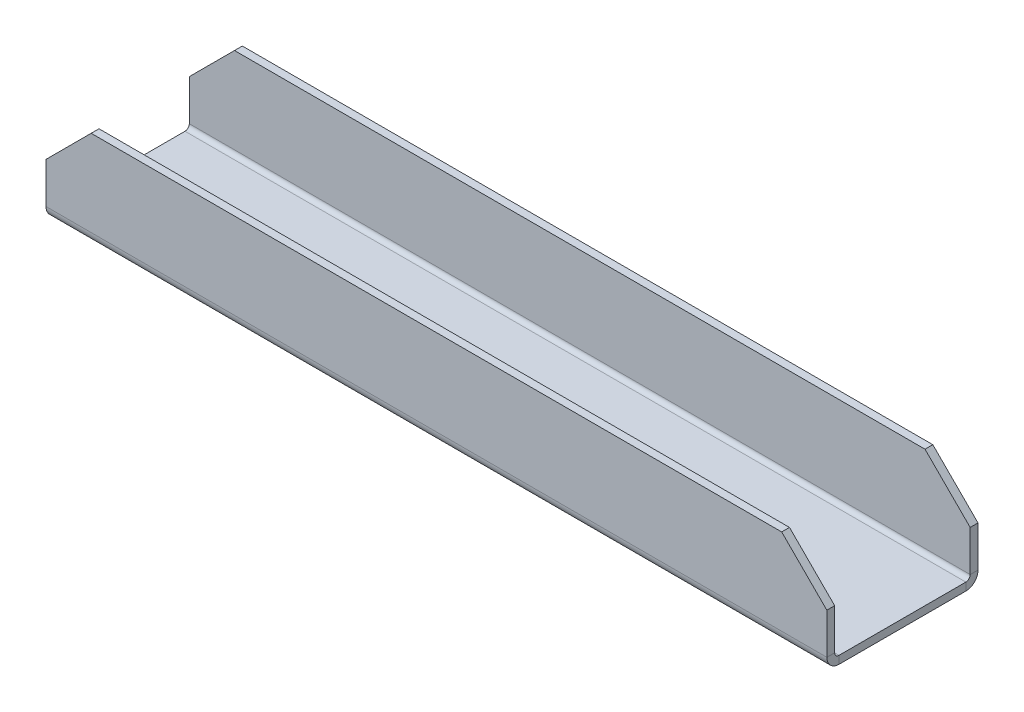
ISO-10303-21;
HEADER;
FILE_DESCRIPTION(('STEP AP214'),'2;1');
FILE_NAME('part.step','',(''),(''),'','','');
FILE_SCHEMA(('AUTOMOTIVE_DESIGN { 1 0 10303 214 1 1 1 1 }'));
ENDSEC;
DATA;
#1=APPLICATION_CONTEXT('core data for automotive mechanical design processes');
#2=APPLICATION_PROTOCOL_DEFINITION('international standard','automotive_design',2000,#1);
#3=PRODUCT_CONTEXT('',#1,'mechanical');
#4=PRODUCT('Part','Part','',(#3));
#5=PRODUCT_RELATED_PRODUCT_CATEGORY('part','',(#4));
#6=PRODUCT_DEFINITION_FORMATION('','',#4);
#7=PRODUCT_DEFINITION_CONTEXT('part definition',#1,'design');
#8=PRODUCT_DEFINITION('design','',#6,#7);
#9=PRODUCT_DEFINITION_SHAPE('','',#8);
#10=(LENGTH_UNIT() NAMED_UNIT(*) SI_UNIT(.MILLI.,.METRE.));
#11=(NAMED_UNIT(*) PLANE_ANGLE_UNIT() SI_UNIT($,.RADIAN.));
#12=(NAMED_UNIT(*) SI_UNIT($,.STERADIAN.) SOLID_ANGLE_UNIT());
#13=UNCERTAINTY_MEASURE_WITH_UNIT(LENGTH_MEASURE(1.E-05),#10,'distance_accuracy_value','');
#14=(GEOMETRIC_REPRESENTATION_CONTEXT(3) GLOBAL_UNCERTAINTY_ASSIGNED_CONTEXT((#13)) GLOBAL_UNIT_ASSIGNED_CONTEXT((#10,
#11,#12)) REPRESENTATION_CONTEXT('',''));
#15=CARTESIAN_POINT('',(0.,0.,0.));
#16=DIRECTION('',(0.,0.,1.));
#17=DIRECTION('',(1.,0.,0.));
#18=AXIS2_PLACEMENT_3D('',#15,#16,#17);
#19=CARTESIAN_POINT('',(114.3,0.,9.2837));
#20=DIRECTION('',(1.,0.,0.));
#21=DIRECTION('',(0.,0.,-1.));
#22=AXIS2_PLACEMENT_3D('',#19,#20,#21);
#23=PLANE('',#22);
#24=DIRECTION('',(0.,-1.,0.));
#25=VECTOR('',#24,1.);
#26=CARTESIAN_POINT('',(114.3,0.,9.2837));
#27=LINE('',#26,#25);
#28=CARTESIAN_POINT('',(114.3,0.,9.2837));
#29=VERTEX_POINT('',#28);
#30=CARTESIAN_POINT('',(114.3,-1.143,9.2837));
#31=VERTEX_POINT('',#30);
#32=EDGE_CURVE('E271',#29,#31,#27,.T.);
#33=ORIENTED_EDGE('',*,*,#32,.F.);
#34=CARTESIAN_POINT('',(114.3,0.635,9.2837));
#35=DIRECTION('',(-1.,0.,0.));
#36=DIRECTION('',(0.,0.,1.));
#37=AXIS2_PLACEMENT_3D('',#34,#35,#36);
#38=CIRCLE('',#37,0.635);
#39=CARTESIAN_POINT('',(114.3,0.634999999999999,9.9187));
#40=VERTEX_POINT('',#39);
#41=EDGE_CURVE('E190',#40,#29,#38,.F.);
#42=ORIENTED_EDGE('',*,*,#41,.F.);
#43=DIRECTION('',(0.,0.,-1.));
#44=VECTOR('',#43,1.);
#45=CARTESIAN_POINT('',(114.3,0.634999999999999,11.0617));
#46=LINE('',#45,#44);
#47=CARTESIAN_POINT('',(114.3,0.634999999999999,11.0617));
#48=VERTEX_POINT('',#47);
#49=EDGE_CURVE('E268',#48,#40,#46,.T.);
#50=ORIENTED_EDGE('',*,*,#49,.F.);
#51=CARTESIAN_POINT('',(114.3,0.635,9.2837));
#52=DIRECTION('',(1.,0.,0.));
#53=DIRECTION('',(0.,0.,-1.));
#54=AXIS2_PLACEMENT_3D('',#51,#52,#53);
#55=CIRCLE('',#54,1.778);
#56=EDGE_CURVE('E200',#48,#31,#55,.T.);
#57=ORIENTED_EDGE('',*,*,#56,.T.);
#58=EDGE_LOOP('',(#33,#42,#50,#57));
#59=FACE_BOUND('',#58,.T.);
#60=ADVANCED_FACE('F35',(#59),#23,.T.);
#61=CARTESIAN_POINT('',(114.3,0.634999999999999,11.0617));
#62=DIRECTION('',(1.,0.,0.));
#63=DIRECTION('',(0.,0.,-1.));
#64=AXIS2_PLACEMENT_3D('',#61,#62,#63);
#65=PLANE('',#64);
#66=DIRECTION('',(0.,0.,-1.));
#67=VECTOR('',#66,1.);
#68=CARTESIAN_POINT('',(114.3,0.,9.9187));
#69=LINE('',#68,#67);
#70=CARTESIAN_POINT('',(114.3,0.,-9.28369999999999));
#71=VERTEX_POINT('',#70);
#72=EDGE_CURVE('E188',#29,#71,#69,.T.);
#73=ORIENTED_EDGE('',*,*,#72,.F.);
#74=ORIENTED_EDGE('',*,*,#32,.T.);
#75=DIRECTION('',(0.,0.,-1.));
#76=VECTOR('',#75,1.);
#77=CARTESIAN_POINT('',(114.3,-1.143,9.9187));
#78=LINE('',#77,#76);
#79=CARTESIAN_POINT('',(114.3,-1.143,-9.28369999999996));
#80=VERTEX_POINT('',#79);
#81=EDGE_CURVE('E203',#31,#80,#78,.T.);
#82=ORIENTED_EDGE('',*,*,#81,.T.);
#83=DIRECTION('',(0.,1.,0.));
#84=VECTOR('',#83,1.);
#85=CARTESIAN_POINT('',(114.3,-1.143,-9.28369999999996));
#86=LINE('',#85,#84);
#87=EDGE_CURVE('E161',#80,#71,#86,.T.);
#88=ORIENTED_EDGE('',*,*,#87,.T.);
#89=EDGE_LOOP('',(#73,#74,#82,#88));
#90=FACE_BOUND('',#89,.T.);
#91=ADVANCED_FACE('F338',(#90),#65,.T.);
#92=CARTESIAN_POINT('',(0.,0.634999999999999,9.9187));
#93=DIRECTION('',(-1.,0.,0.));
#94=DIRECTION('',(0.,0.,1.));
#95=AXIS2_PLACEMENT_3D('',#92,#93,#94);
#96=PLANE('',#95);
#97=DIRECTION('',(0.,0.,1.));
#98=VECTOR('',#97,1.);
#99=CARTESIAN_POINT('',(0.,0.634999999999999,9.9187));
#100=LINE('',#99,#98);
#101=CARTESIAN_POINT('',(0.,0.634999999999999,9.9187));
#102=VERTEX_POINT('',#101);
#103=CARTESIAN_POINT('',(0.,0.634999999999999,11.0617));
#104=VERTEX_POINT('',#103);
#105=EDGE_CURVE('E265',#102,#104,#100,.T.);
#106=ORIENTED_EDGE('',*,*,#105,.F.);
#107=CARTESIAN_POINT('',(0.,0.635,9.2837));
#108=DIRECTION('',(-1.,0.,0.));
#109=DIRECTION('',(0.,0.,1.));
#110=AXIS2_PLACEMENT_3D('',#107,#108,#109);
#111=CIRCLE('',#110,0.635);
#112=CARTESIAN_POINT('',(0.,0.,9.2837));
#113=VERTEX_POINT('',#112);
#114=EDGE_CURVE('E217',#102,#113,#111,.F.);
#115=ORIENTED_EDGE('',*,*,#114,.T.);
#116=DIRECTION('',(0.,1.,0.));
#117=VECTOR('',#116,1.);
#118=CARTESIAN_POINT('',(0.,-1.143,9.2837));
#119=LINE('',#118,#117);
#120=CARTESIAN_POINT('',(0.,-1.143,9.2837));
#121=VERTEX_POINT('',#120);
#122=EDGE_CURVE('E160',#121,#113,#119,.T.);
#123=ORIENTED_EDGE('',*,*,#122,.F.);
#124=CARTESIAN_POINT('',(0.,0.635,9.2837));
#125=DIRECTION('',(1.,0.,0.));
#126=DIRECTION('',(0.,0.,-1.));
#127=AXIS2_PLACEMENT_3D('',#124,#125,#126);
#128=CIRCLE('',#127,1.778);
#129=EDGE_CURVE('E224',#104,#121,#128,.T.);
#130=ORIENTED_EDGE('',*,*,#129,.F.);
#131=EDGE_LOOP('',(#106,#115,#123,#130));
#132=FACE_BOUND('',#131,.T.);
#133=ADVANCED_FACE('F319',(#132),#96,.T.);
#134=CARTESIAN_POINT('',(0.,-1.143,9.2837));
#135=DIRECTION('',(-1.,0.,0.));
#136=DIRECTION('',(0.,0.,1.));
#137=AXIS2_PLACEMENT_3D('',#134,#135,#136);
#138=PLANE('',#137);
#139=DIRECTION('',(0.,1.,0.));
#140=VECTOR('',#139,1.);
#141=CARTESIAN_POINT('',(0.,0.,11.0617));
#142=LINE('',#141,#140);
#143=CARTESIAN_POINT('',(0.,6.61246666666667,11.0617));
#144=VERTEX_POINT('',#143);
#145=EDGE_CURVE('E222',#144,#104,#142,.F.);
#146=ORIENTED_EDGE('',*,*,#145,.F.);
#147=DIRECTION('',(0.,0.,-1.));
#148=VECTOR('',#147,1.);
#149=CARTESIAN_POINT('',(0.,6.61246666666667,9.2837));
#150=LINE('',#149,#148);
#151=CARTESIAN_POINT('',(0.,6.61246666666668,9.9187));
#152=VERTEX_POINT('',#151);
#153=EDGE_CURVE('E299',#144,#152,#150,.T.);
#154=ORIENTED_EDGE('',*,*,#153,.T.);
#155=DIRECTION('',(0.,-1.,0.));
#156=VECTOR('',#155,1.);
#157=CARTESIAN_POINT('',(0.,0.,9.9187));
#158=LINE('',#157,#156);
#159=EDGE_CURVE('E220',#152,#102,#158,.T.);
#160=ORIENTED_EDGE('',*,*,#159,.T.);
#161=ORIENTED_EDGE('',*,*,#105,.T.);
#162=EDGE_LOOP('',(#146,#154,#160,#161));
#163=FACE_BOUND('',#162,.T.);
#164=ADVANCED_FACE('F305',(#163),#138,.T.);
#165=CARTESIAN_POINT('',(114.3,0.635,-9.9187));
#166=DIRECTION('',(1.,0.,0.));
#167=DIRECTION('',(0.,0.,-1.));
#168=AXIS2_PLACEMENT_3D('',#165,#166,#167);
#169=PLANE('',#168);
#170=DIRECTION('',(0.,0.,-1.));
#171=VECTOR('',#170,1.);
#172=CARTESIAN_POINT('',(114.3,0.635,-9.9187));
#173=LINE('',#172,#171);
#174=CARTESIAN_POINT('',(114.3,0.635,-9.9187));
#175=VERTEX_POINT('',#174);
#176=CARTESIAN_POINT('',(114.3,0.635,-11.0617));
#177=VERTEX_POINT('',#176);
#178=EDGE_CURVE('E148',#175,#177,#173,.T.);
#179=ORIENTED_EDGE('',*,*,#178,.F.);
#180=CARTESIAN_POINT('',(114.3,0.635,-9.2837));
#181=DIRECTION('',(-1.,0.,0.));
#182=DIRECTION('',(0.,0.,1.));
#183=AXIS2_PLACEMENT_3D('',#180,#181,#182);
#184=CIRCLE('',#183,0.635);
#185=EDGE_CURVE('E152',#71,#175,#184,.F.);
#186=ORIENTED_EDGE('',*,*,#185,.F.);
#187=ORIENTED_EDGE('',*,*,#87,.F.);
#188=CARTESIAN_POINT('',(114.3,0.635,-9.2837));
#189=DIRECTION('',(1.,0.,0.));
#190=DIRECTION('',(0.,0.,-1.));
#191=AXIS2_PLACEMENT_3D('',#188,#189,#190);
#192=CIRCLE('',#191,1.778);
#193=EDGE_CURVE('E155',#80,#177,#192,.T.);
#194=ORIENTED_EDGE('',*,*,#193,.T.);
#195=EDGE_LOOP('',(#179,#186,#187,#194));
#196=FACE_BOUND('',#195,.T.);
#197=ADVANCED_FACE('F150',(#196),#169,.T.);
#198=CARTESIAN_POINT('',(114.3,-1.143,-9.28369999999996));
#199=DIRECTION('',(1.,0.,0.));
#200=DIRECTION('',(0.,0.,-1.));
#201=AXIS2_PLACEMENT_3D('',#198,#199,#200);
#202=PLANE('',#201);
#203=DIRECTION('',(0.,1.,0.));
#204=VECTOR('',#203,1.);
#205=CARTESIAN_POINT('',(114.3,0.,-11.0617));
#206=LINE('',#205,#204);
#207=CARTESIAN_POINT('',(114.3,6.61246666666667,-11.0617));
#208=VERTEX_POINT('',#207);
#209=EDGE_CURVE('E183',#177,#208,#206,.T.);
#210=ORIENTED_EDGE('',*,*,#209,.T.);
#211=DIRECTION('',(0.,0.,1.));
#212=VECTOR('',#211,1.);
#213=CARTESIAN_POINT('',(114.3,6.61246666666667,-9.28369999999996));
#214=LINE('',#213,#212);
#215=CARTESIAN_POINT('',(114.3,6.61246666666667,-9.9187));
#216=VERTEX_POINT('',#215);
#217=EDGE_CURVE('E182',#208,#216,#214,.T.);
#218=ORIENTED_EDGE('',*,*,#217,.T.);
#219=DIRECTION('',(0.,1.,0.));
#220=VECTOR('',#219,1.);
#221=CARTESIAN_POINT('',(114.3,0.,-9.9187));
#222=LINE('',#221,#220);
#223=EDGE_CURVE('E170',#175,#216,#222,.T.);
#224=ORIENTED_EDGE('',*,*,#223,.F.);
#225=ORIENTED_EDGE('',*,*,#178,.T.);
#226=EDGE_LOOP('',(#210,#218,#224,#225));
#227=FACE_BOUND('',#226,.T.);
#228=ADVANCED_FACE('F180',(#227),#202,.T.);
#229=CARTESIAN_POINT('',(0.,0.,-9.28369999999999));
#230=DIRECTION('',(-1.,0.,0.));
#231=DIRECTION('',(0.,0.,1.));
#232=AXIS2_PLACEMENT_3D('',#229,#230,#231);
#233=PLANE('',#232);
#234=DIRECTION('',(0.,-1.,0.));
#235=VECTOR('',#234,1.);
#236=CARTESIAN_POINT('',(0.,0.,-9.28369999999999));
#237=LINE('',#236,#235);
#238=CARTESIAN_POINT('',(0.,0.,-9.28369999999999));
#239=VERTEX_POINT('',#238);
#240=CARTESIAN_POINT('',(0.,-1.143,-9.28369999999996));
#241=VERTEX_POINT('',#240);
#242=EDGE_CURVE('E261',#239,#241,#237,.T.);
#243=ORIENTED_EDGE('',*,*,#242,.F.);
#244=CARTESIAN_POINT('',(0.,0.635,-9.2837));
#245=DIRECTION('',(-1.,0.,0.));
#246=DIRECTION('',(0.,0.,1.));
#247=AXIS2_PLACEMENT_3D('',#244,#245,#246);
#248=CIRCLE('',#247,0.635);
#249=CARTESIAN_POINT('',(0.,0.635,-9.9187));
#250=VERTEX_POINT('',#249);
#251=EDGE_CURVE('E212',#239,#250,#248,.F.);
#252=ORIENTED_EDGE('',*,*,#251,.T.);
#253=DIRECTION('',(0.,0.,1.));
#254=VECTOR('',#253,1.);
#255=CARTESIAN_POINT('',(0.,0.635,-11.0617));
#256=LINE('',#255,#254);
#257=CARTESIAN_POINT('',(0.,0.635,-11.0617));
#258=VERTEX_POINT('',#257);
#259=EDGE_CURVE('E259',#258,#250,#256,.T.);
#260=ORIENTED_EDGE('',*,*,#259,.F.);
#261=CARTESIAN_POINT('',(0.,0.635,-9.2837));
#262=DIRECTION('',(1.,0.,0.));
#263=DIRECTION('',(0.,0.,-1.));
#264=AXIS2_PLACEMENT_3D('',#261,#262,#263);
#265=CIRCLE('',#264,1.778);
#266=EDGE_CURVE('E230',#241,#258,#265,.T.);
#267=ORIENTED_EDGE('',*,*,#266,.F.);
#268=EDGE_LOOP('',(#243,#252,#260,#267));
#269=FACE_BOUND('',#268,.T.);
#270=ADVANCED_FACE('F369',(#269),#233,.T.);
#271=CARTESIAN_POINT('',(0.,0.635,-11.0617));
#272=DIRECTION('',(-1.,0.,0.));
#273=DIRECTION('',(0.,0.,1.));
#274=AXIS2_PLACEMENT_3D('',#271,#272,#273);
#275=PLANE('',#274);
#276=DIRECTION('',(0.,0.,-1.));
#277=VECTOR('',#276,1.);
#278=CARTESIAN_POINT('',(0.,0.,9.9187));
#279=LINE('',#278,#277);
#280=EDGE_CURVE('E214',#113,#239,#279,.T.);
#281=ORIENTED_EDGE('',*,*,#280,.T.);
#282=ORIENTED_EDGE('',*,*,#242,.T.);
#283=DIRECTION('',(0.,0.,-1.));
#284=VECTOR('',#283,1.);
#285=CARTESIAN_POINT('',(0.,-1.143,9.9187));
#286=LINE('',#285,#284);
#287=EDGE_CURVE('E227',#121,#241,#286,.T.);
#288=ORIENTED_EDGE('',*,*,#287,.F.);
#289=ORIENTED_EDGE('',*,*,#122,.T.);
#290=EDGE_LOOP('',(#281,#282,#288,#289));
#291=FACE_BOUND('',#290,.T.);
#292=ADVANCED_FACE('F377',(#291),#275,.T.);
#293=CARTESIAN_POINT('',(114.3,0.,-11.0617));
#294=DIRECTION('',(0.,0.,1.));
#295=DIRECTION('',(1.,0.,0.));
#296=AXIS2_PLACEMENT_3D('',#293,#294,#295);
#297=PLANE('',#296);
#298=DIRECTION('',(0.,1.,0.));
#299=VECTOR('',#298,1.);
#300=CARTESIAN_POINT('',(0.,0.,-11.0617));
#301=LINE('',#300,#299);
#302=CARTESIAN_POINT('',(0.,6.61246666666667,-11.0617));
#303=VERTEX_POINT('',#302);
#304=EDGE_CURVE('E208',#258,#303,#301,.T.);
#305=ORIENTED_EDGE('',*,*,#304,.T.);
#306=DIRECTION('',(-0.707106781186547,-0.707106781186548,0.));
#307=VECTOR('',#306,1.);
#308=CARTESIAN_POINT('',(0.,6.61246666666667,-11.0617));
#309=LINE('',#308,#307);
#310=CARTESIAN_POINT('',(6.61246666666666,13.2249333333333,-11.0617));
#311=VERTEX_POINT('',#310);
#312=EDGE_CURVE('E293',#303,#311,#309,.F.);
#313=ORIENTED_EDGE('',*,*,#312,.T.);
#314=DIRECTION('',(-1.,0.,0.));
#315=VECTOR('',#314,1.);
#316=CARTESIAN_POINT('',(114.3,13.2249333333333,-11.0617));
#317=LINE('',#316,#315);
#318=CARTESIAN_POINT('',(107.687533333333,13.2249333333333,-11.0617));
#319=VERTEX_POINT('',#318);
#320=EDGE_CURVE('E256',#319,#311,#317,.T.);
#321=ORIENTED_EDGE('',*,*,#320,.F.);
#322=DIRECTION('',(-0.707106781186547,0.707106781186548,0.));
#323=VECTOR('',#322,1.);
#324=CARTESIAN_POINT('',(107.687533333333,13.2249333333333,-11.0617));
#325=LINE('',#324,#323);
#326=EDGE_CURVE('E285',#319,#208,#325,.F.);
#327=ORIENTED_EDGE('',*,*,#326,.T.);
#328=ORIENTED_EDGE('',*,*,#209,.F.);
#329=DIRECTION('',(-1.,0.,0.));
#330=VECTOR('',#329,1.);
#331=CARTESIAN_POINT('',(114.3,0.635,-11.0617));
#332=LINE('',#331,#330);
#333=EDGE_CURVE('E207',#177,#258,#332,.T.);
#334=ORIENTED_EDGE('',*,*,#333,.T.);
#335=EDGE_LOOP('',(#305,#313,#321,#327,#328,#334));
#336=FACE_BOUND('',#335,.T.);
#337=ADVANCED_FACE('F375',(#336),#297,.F.);
#338=CARTESIAN_POINT('',(114.3,13.2249333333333,-9.9187));
#339=DIRECTION('',(0.,1.,0.));
#340=DIRECTION('',(0.,0.,1.));
#341=AXIS2_PLACEMENT_3D('',#338,#339,#340);
#342=PLANE('',#341);
#343=ORIENTED_EDGE('',*,*,#320,.T.);
#344=DIRECTION('',(0.,0.,1.));
#345=VECTOR('',#344,1.);
#346=CARTESIAN_POINT('',(6.61246666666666,13.2249333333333,-9.9187));
#347=LINE('',#346,#345);
#348=CARTESIAN_POINT('',(6.61246666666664,13.2249333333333,-9.9187));
#349=VERTEX_POINT('',#348);
#350=EDGE_CURVE('E295',#311,#349,#347,.T.);
#351=ORIENTED_EDGE('',*,*,#350,.T.);
#352=DIRECTION('',(-1.,0.,0.));
#353=VECTOR('',#352,1.);
#354=CARTESIAN_POINT('',(114.3,13.2249333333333,-9.9187));
#355=LINE('',#354,#353);
#356=CARTESIAN_POINT('',(107.687533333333,13.2249333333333,-9.9187));
#357=VERTEX_POINT('',#356);
#358=EDGE_CURVE('E177',#357,#349,#355,.T.);
#359=ORIENTED_EDGE('',*,*,#358,.F.);
#360=DIRECTION('',(0.,0.,-1.));
#361=VECTOR('',#360,1.);
#362=CARTESIAN_POINT('',(107.687533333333,13.2249333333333,-9.9187));
#363=LINE('',#362,#361);
#364=EDGE_CURVE('E282',#357,#319,#363,.T.);
#365=ORIENTED_EDGE('',*,*,#364,.T.);
#366=EDGE_LOOP('',(#343,#351,#359,#365));
#367=FACE_BOUND('',#366,.T.);
#368=ADVANCED_FACE('F361',(#367),#342,.T.);
#369=CARTESIAN_POINT('',(114.3,0.,-9.9187));
#370=DIRECTION('',(0.,0.,1.));
#371=DIRECTION('',(1.,0.,0.));
#372=AXIS2_PLACEMENT_3D('',#369,#370,#371);
#373=PLANE('',#372);
#374=ORIENTED_EDGE('',*,*,#358,.T.);
#375=DIRECTION('',(0.707106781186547,0.707106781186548,0.));
#376=VECTOR('',#375,1.);
#377=CARTESIAN_POINT('',(53.8437666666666,60.4562333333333,-9.9187));
#378=LINE('',#377,#376);
#379=CARTESIAN_POINT('',(0.,6.61246666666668,-9.9187));
#380=VERTEX_POINT('',#379);
#381=EDGE_CURVE('E297',#349,#380,#378,.F.);
#382=ORIENTED_EDGE('',*,*,#381,.T.);
#383=DIRECTION('',(0.,1.,0.));
#384=VECTOR('',#383,1.);
#385=CARTESIAN_POINT('',(0.,0.,-9.9187));
#386=LINE('',#385,#384);
#387=EDGE_CURVE('E173',#250,#380,#386,.T.);
#388=ORIENTED_EDGE('',*,*,#387,.F.);
#389=DIRECTION('',(-1.,0.,0.));
#390=VECTOR('',#389,1.);
#391=CARTESIAN_POINT('',(114.3,0.635,-9.9187));
#392=LINE('',#391,#390);
#393=EDGE_CURVE('E167',#175,#250,#392,.T.);
#394=ORIENTED_EDGE('',*,*,#393,.F.);
#395=ORIENTED_EDGE('',*,*,#223,.T.);
#396=DIRECTION('',(0.707106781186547,-0.707106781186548,0.));
#397=VECTOR('',#396,1.);
#398=CARTESIAN_POINT('',(117.606233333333,3.30623333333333,-9.9187));
#399=LINE('',#398,#397);
#400=EDGE_CURVE('E288',#216,#357,#399,.F.);
#401=ORIENTED_EDGE('',*,*,#400,.T.);
#402=EDGE_LOOP('',(#374,#382,#388,#394,#395,#401));
#403=FACE_BOUND('',#402,.T.);
#404=ADVANCED_FACE('F169',(#403),#373,.T.);
#405=CARTESIAN_POINT('',(114.3,0.635,-9.2837));
#406=DIRECTION('',(-1.,0.,0.));
#407=DIRECTION('',(0.,0.,1.));
#408=AXIS2_PLACEMENT_3D('',#405,#406,#407);
#409=CYLINDRICAL_SURFACE('',#408,0.635);
#410=ORIENTED_EDGE('',*,*,#251,.F.);
#411=DIRECTION('',(-1.,0.,0.));
#412=VECTOR('',#411,1.);
#413=CARTESIAN_POINT('',(114.3,0.,-9.28369999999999));
#414=LINE('',#413,#412);
#415=EDGE_CURVE('E178',#71,#239,#414,.T.);
#416=ORIENTED_EDGE('',*,*,#415,.F.);
#417=ORIENTED_EDGE('',*,*,#185,.T.);
#418=ORIENTED_EDGE('',*,*,#393,.T.);
#419=EDGE_LOOP('',(#410,#416,#417,#418));
#420=FACE_BOUND('',#419,.T.);
#421=ADVANCED_FACE('F186',(#420),#409,.F.);
#422=CARTESIAN_POINT('',(114.3,0.,9.9187));
#423=DIRECTION('',(0.,1.,0.));
#424=DIRECTION('',(0.,0.,1.));
#425=AXIS2_PLACEMENT_3D('',#422,#423,#424);
#426=PLANE('',#425);
#427=ORIENTED_EDGE('',*,*,#280,.F.);
#428=DIRECTION('',(-1.,0.,0.));
#429=VECTOR('',#428,1.);
#430=CARTESIAN_POINT('',(114.3,0.,9.2837));
#431=LINE('',#430,#429);
#432=EDGE_CURVE('E251',#29,#113,#431,.T.);
#433=ORIENTED_EDGE('',*,*,#432,.F.);
#434=ORIENTED_EDGE('',*,*,#72,.T.);
#435=ORIENTED_EDGE('',*,*,#415,.T.);
#436=EDGE_LOOP('',(#427,#433,#434,#435));
#437=FACE_BOUND('',#436,.T.);
#438=ADVANCED_FACE('F432',(#437),#426,.T.);
#439=CARTESIAN_POINT('',(114.3,0.635,9.2837));
#440=DIRECTION('',(-1.,0.,0.));
#441=DIRECTION('',(0.,0.,1.));
#442=AXIS2_PLACEMENT_3D('',#439,#440,#441);
#443=CYLINDRICAL_SURFACE('',#442,0.635);
#444=ORIENTED_EDGE('',*,*,#114,.F.);
#445=DIRECTION('',(-1.,0.,0.));
#446=VECTOR('',#445,1.);
#447=CARTESIAN_POINT('',(114.3,0.634999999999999,9.9187));
#448=LINE('',#447,#446);
#449=EDGE_CURVE('E248',#40,#102,#448,.T.);
#450=ORIENTED_EDGE('',*,*,#449,.F.);
#451=ORIENTED_EDGE('',*,*,#41,.T.);
#452=ORIENTED_EDGE('',*,*,#432,.T.);
#453=EDGE_LOOP('',(#444,#450,#451,#452));
#454=FACE_BOUND('',#453,.T.);
#455=ADVANCED_FACE('F315',(#454),#443,.F.);
#456=CARTESIAN_POINT('',(114.3,0.,9.9187));
#457=DIRECTION('',(0.,0.,-1.));
#458=DIRECTION('',(-1.,0.,0.));
#459=AXIS2_PLACEMENT_3D('',#456,#457,#458);
#460=PLANE('',#459);
#461=ORIENTED_EDGE('',*,*,#159,.F.);
#462=DIRECTION('',(-0.707106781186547,-0.707106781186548,0.));
#463=VECTOR('',#462,1.);
#464=CARTESIAN_POINT('',(53.8437666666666,60.4562333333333,9.9187));
#465=LINE('',#464,#463);
#466=CARTESIAN_POINT('',(6.61246666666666,13.2249333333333,9.9187));
#467=VERTEX_POINT('',#466);
#468=EDGE_CURVE('E57',#152,#467,#465,.F.);
#469=ORIENTED_EDGE('',*,*,#468,.T.);
#470=DIRECTION('',(-1.,0.,0.));
#471=VECTOR('',#470,1.);
#472=CARTESIAN_POINT('',(114.3,13.2249333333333,9.9187));
#473=LINE('',#472,#471);
#474=CARTESIAN_POINT('',(107.687533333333,13.2249333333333,9.9187));
#475=VERTEX_POINT('',#474);
#476=EDGE_CURVE('E246',#475,#467,#473,.T.);
#477=ORIENTED_EDGE('',*,*,#476,.F.);
#478=DIRECTION('',(0.707106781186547,-0.707106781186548,0.));
#479=VECTOR('',#478,1.);
#480=CARTESIAN_POINT('',(117.606233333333,3.30623333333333,9.9187));
#481=LINE('',#480,#479);
#482=CARTESIAN_POINT('',(114.3,6.61246666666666,9.9187));
#483=VERTEX_POINT('',#482);
#484=EDGE_CURVE('E276',#475,#483,#481,.T.);
#485=ORIENTED_EDGE('',*,*,#484,.T.);
#486=DIRECTION('',(0.,-1.,0.));
#487=VECTOR('',#486,1.);
#488=CARTESIAN_POINT('',(114.3,0.,9.9187));
#489=LINE('',#488,#487);
#490=EDGE_CURVE('E196',#483,#40,#489,.T.);
#491=ORIENTED_EDGE('',*,*,#490,.T.);
#492=ORIENTED_EDGE('',*,*,#449,.T.);
#493=EDGE_LOOP('',(#461,#469,#477,#485,#491,#492));
#494=FACE_BOUND('',#493,.T.);
#495=ADVANCED_FACE('F309',(#494),#460,.T.);
#496=CARTESIAN_POINT('',(114.3,13.2249333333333,11.0617));
#497=DIRECTION('',(0.,1.,0.));
#498=DIRECTION('',(0.,0.,1.));
#499=AXIS2_PLACEMENT_3D('',#496,#497,#498);
#500=PLANE('',#499);
#501=ORIENTED_EDGE('',*,*,#476,.T.);
#502=DIRECTION('',(0.,0.,1.));
#503=VECTOR('',#502,1.);
#504=CARTESIAN_POINT('',(6.61246666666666,13.2249333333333,11.0617));
#505=LINE('',#504,#503);
#506=CARTESIAN_POINT('',(6.61246666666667,13.2249333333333,11.0617));
#507=VERTEX_POINT('',#506);
#508=EDGE_CURVE('E43',#467,#507,#505,.T.);
#509=ORIENTED_EDGE('',*,*,#508,.T.);
#510=DIRECTION('',(-1.,0.,0.));
#511=VECTOR('',#510,1.);
#512=CARTESIAN_POINT('',(114.3,13.2249333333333,11.0617));
#513=LINE('',#512,#511);
#514=CARTESIAN_POINT('',(107.687533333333,13.2249333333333,11.0617));
#515=VERTEX_POINT('',#514);
#516=EDGE_CURVE('E244',#515,#507,#513,.T.);
#517=ORIENTED_EDGE('',*,*,#516,.F.);
#518=DIRECTION('',(0.,0.,-1.));
#519=VECTOR('',#518,1.);
#520=CARTESIAN_POINT('',(107.687533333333,13.2249333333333,9.9187));
#521=LINE('',#520,#519);
#522=EDGE_CURVE('E273',#515,#475,#521,.T.);
#523=ORIENTED_EDGE('',*,*,#522,.T.);
#524=EDGE_LOOP('',(#501,#509,#517,#523));
#525=FACE_BOUND('',#524,.T.);
#526=ADVANCED_FACE('F567',(#525),#500,.T.);
#527=CARTESIAN_POINT('',(114.3,0.,11.0617));
#528=DIRECTION('',(0.,0.,-1.));
#529=DIRECTION('',(-1.,0.,0.));
#530=AXIS2_PLACEMENT_3D('',#527,#528,#529);
#531=PLANE('',#530);
#532=ORIENTED_EDGE('',*,*,#516,.T.);
#533=DIRECTION('',(0.707106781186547,0.707106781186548,0.));
#534=VECTOR('',#533,1.);
#535=CARTESIAN_POINT('',(0.,6.61246666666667,11.0617));
#536=LINE('',#535,#534);
#537=EDGE_CURVE('E11',#507,#144,#536,.F.);
#538=ORIENTED_EDGE('',*,*,#537,.T.);
#539=ORIENTED_EDGE('',*,*,#145,.T.);
#540=DIRECTION('',(-1.,0.,0.));
#541=VECTOR('',#540,1.);
#542=CARTESIAN_POINT('',(114.3,0.634999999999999,11.0617));
#543=LINE('',#542,#541);
#544=EDGE_CURVE('E241',#48,#104,#543,.T.);
#545=ORIENTED_EDGE('',*,*,#544,.F.);
#546=DIRECTION('',(0.,1.,0.));
#547=VECTOR('',#546,1.);
#548=CARTESIAN_POINT('',(114.3,0.,11.0617));
#549=LINE('',#548,#547);
#550=CARTESIAN_POINT('',(114.3,6.61246666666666,11.0617));
#551=VERTEX_POINT('',#550);
#552=EDGE_CURVE('E198',#551,#48,#549,.F.);
#553=ORIENTED_EDGE('',*,*,#552,.F.);
#554=DIRECTION('',(-0.707106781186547,0.707106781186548,0.));
#555=VECTOR('',#554,1.);
#556=CARTESIAN_POINT('',(107.687533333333,13.2249333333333,11.0617));
#557=LINE('',#556,#555);
#558=EDGE_CURVE('E280',#551,#515,#557,.T.);
#559=ORIENTED_EDGE('',*,*,#558,.T.);
#560=EDGE_LOOP('',(#532,#538,#539,#545,#553,#559));
#561=FACE_BOUND('',#560,.T.);
#562=ADVANCED_FACE('F328',(#561),#531,.F.);
#563=CARTESIAN_POINT('',(114.3,0.635,9.2837));
#564=DIRECTION('',(-1.,0.,0.));
#565=DIRECTION('',(0.,0.,1.));
#566=AXIS2_PLACEMENT_3D('',#563,#564,#565);
#567=CYLINDRICAL_SURFACE('',#566,1.778);
#568=ORIENTED_EDGE('',*,*,#129,.T.);
#569=DIRECTION('',(-1.,0.,0.));
#570=VECTOR('',#569,1.);
#571=CARTESIAN_POINT('',(114.3,-1.143,9.2837));
#572=LINE('',#571,#570);
#573=EDGE_CURVE('E238',#31,#121,#572,.T.);
#574=ORIENTED_EDGE('',*,*,#573,.F.);
#575=ORIENTED_EDGE('',*,*,#56,.F.);
#576=ORIENTED_EDGE('',*,*,#544,.T.);
#577=EDGE_LOOP('',(#568,#574,#575,#576));
#578=FACE_BOUND('',#577,.T.);
#579=ADVANCED_FACE('F324',(#578),#567,.T.);
#580=CARTESIAN_POINT('',(114.3,-1.143,9.9187));
#581=DIRECTION('',(0.,1.,0.));
#582=DIRECTION('',(0.,0.,1.));
#583=AXIS2_PLACEMENT_3D('',#580,#581,#582);
#584=PLANE('',#583);
#585=ORIENTED_EDGE('',*,*,#287,.T.);
#586=DIRECTION('',(-1.,0.,0.));
#587=VECTOR('',#586,1.);
#588=CARTESIAN_POINT('',(114.3,-1.143,-9.28369999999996));
#589=LINE('',#588,#587);
#590=EDGE_CURVE('E235',#80,#241,#589,.T.);
#591=ORIENTED_EDGE('',*,*,#590,.F.);
#592=ORIENTED_EDGE('',*,*,#81,.F.);
#593=ORIENTED_EDGE('',*,*,#573,.T.);
#594=EDGE_LOOP('',(#585,#591,#592,#593));
#595=FACE_BOUND('',#594,.T.);
#596=ADVANCED_FACE('F465',(#595),#584,.F.);
#597=CARTESIAN_POINT('',(114.3,0.635,-9.2837));
#598=DIRECTION('',(-1.,0.,0.));
#599=DIRECTION('',(0.,0.,1.));
#600=AXIS2_PLACEMENT_3D('',#597,#598,#599);
#601=CYLINDRICAL_SURFACE('',#600,1.778);
#602=ORIENTED_EDGE('',*,*,#266,.T.);
#603=ORIENTED_EDGE('',*,*,#333,.F.);
#604=ORIENTED_EDGE('',*,*,#193,.F.);
#605=ORIENTED_EDGE('',*,*,#590,.T.);
#606=EDGE_LOOP('',(#602,#603,#604,#605));
#607=FACE_BOUND('',#606,.T.);
#608=ADVANCED_FACE('F371',(#607),#601,.T.);
#609=CARTESIAN_POINT('',(114.3,0.635,-9.2837));
#610=DIRECTION('',(-1.,0.,0.));
#611=DIRECTION('',(0.,0.,1.));
#612=AXIS2_PLACEMENT_3D('',#609,#610,#611);
#613=PLANE('',#612);
#614=ORIENTED_EDGE('',*,*,#490,.F.);
#615=DIRECTION('',(0.,0.,1.));
#616=VECTOR('',#615,1.);
#617=CARTESIAN_POINT('',(114.3,6.61246666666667,11.0617));
#618=LINE('',#617,#616);
#619=EDGE_CURVE('E278',#483,#551,#618,.T.);
#620=ORIENTED_EDGE('',*,*,#619,.T.);
#621=ORIENTED_EDGE('',*,*,#552,.T.);
#622=ORIENTED_EDGE('',*,*,#49,.T.);
#623=EDGE_LOOP('',(#614,#620,#621,#622));
#624=FACE_BOUND('',#623,.T.);
#625=ADVANCED_FACE('F485',(#624),#613,.F.);
#626=CARTESIAN_POINT('',(0.,0.635,-9.2837));
#627=DIRECTION('',(-1.,0.,0.));
#628=DIRECTION('',(0.,0.,1.));
#629=AXIS2_PLACEMENT_3D('',#626,#627,#628);
#630=PLANE('',#629);
#631=ORIENTED_EDGE('',*,*,#387,.T.);
#632=DIRECTION('',(0.,0.,-1.));
#633=VECTOR('',#632,1.);
#634=CARTESIAN_POINT('',(0.,6.61246666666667,-9.2837));
#635=LINE('',#634,#633);
#636=EDGE_CURVE('E290',#380,#303,#635,.T.);
#637=ORIENTED_EDGE('',*,*,#636,.T.);
#638=ORIENTED_EDGE('',*,*,#304,.F.);
#639=ORIENTED_EDGE('',*,*,#259,.T.);
#640=EDGE_LOOP('',(#631,#637,#638,#639));
#641=FACE_BOUND('',#640,.T.);
#642=ADVANCED_FACE('F351',(#641),#630,.T.);
#643=CARTESIAN_POINT('',(107.687533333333,13.2249333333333,11.0617));
#644=DIRECTION('',(0.707106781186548,0.707106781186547,0.));
#645=DIRECTION('',(-0.707106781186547,0.707106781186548,0.));
#646=AXIS2_PLACEMENT_3D('',#643,#644,#645);
#647=PLANE('',#646);
#648=ORIENTED_EDGE('',*,*,#558,.F.);
#649=ORIENTED_EDGE('',*,*,#619,.F.);
#650=ORIENTED_EDGE('',*,*,#484,.F.);
#651=ORIENTED_EDGE('',*,*,#522,.F.);
#652=EDGE_LOOP('',(#648,#649,#650,#651));
#653=FACE_BOUND('',#652,.T.);
#654=ADVANCED_FACE('F348',(#653),#647,.T.);
#655=CARTESIAN_POINT('',(107.687533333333,13.2249333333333,-9.9187));
#656=DIRECTION('',(-0.707106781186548,-0.707106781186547,0.));
#657=DIRECTION('',(0.707106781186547,-0.707106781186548,0.));
#658=AXIS2_PLACEMENT_3D('',#655,#656,#657);
#659=PLANE('',#658);
#660=ORIENTED_EDGE('',*,*,#400,.F.);
#661=ORIENTED_EDGE('',*,*,#217,.F.);
#662=ORIENTED_EDGE('',*,*,#326,.F.);
#663=ORIENTED_EDGE('',*,*,#364,.F.);
#664=EDGE_LOOP('',(#660,#661,#662,#663));
#665=FACE_BOUND('',#664,.T.);
#666=ADVANCED_FACE('F335',(#665),#659,.F.);
#667=CARTESIAN_POINT('',(0.,6.61246666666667,-9.2837));
#668=DIRECTION('',(0.707106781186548,-0.707106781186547,0.));
#669=DIRECTION('',(0.707106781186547,0.707106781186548,0.));
#670=AXIS2_PLACEMENT_3D('',#667,#668,#669);
#671=PLANE('',#670);
#672=ORIENTED_EDGE('',*,*,#381,.F.);
#673=ORIENTED_EDGE('',*,*,#350,.F.);
#674=ORIENTED_EDGE('',*,*,#312,.F.);
#675=ORIENTED_EDGE('',*,*,#636,.F.);
#676=EDGE_LOOP('',(#672,#673,#674,#675));
#677=FACE_BOUND('',#676,.T.);
#678=ADVANCED_FACE('F331',(#677),#671,.F.);
#679=CARTESIAN_POINT('',(0.,6.61246666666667,9.2837));
#680=DIRECTION('',(0.707106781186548,-0.707106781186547,0.));
#681=DIRECTION('',(0.707106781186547,0.707106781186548,0.));
#682=AXIS2_PLACEMENT_3D('',#679,#680,#681);
#683=PLANE('',#682);
#684=ORIENTED_EDGE('',*,*,#537,.F.);
#685=ORIENTED_EDGE('',*,*,#508,.F.);
#686=ORIENTED_EDGE('',*,*,#468,.F.);
#687=ORIENTED_EDGE('',*,*,#153,.F.);
#688=EDGE_LOOP('',(#684,#685,#686,#687));
#689=FACE_BOUND('',#688,.T.);
#690=ADVANCED_FACE('F37',(#689),#683,.F.);
#691=CLOSED_SHELL('',(#60,#91,#133,#164,#197,#228,#270,#292,#337,#368,#404,#421,#438,#455,#495,
#526,#562,#579,#596,#608,#625,#642,#654,#666,#678,#690));
#692=MANIFOLD_SOLID_BREP('B2',#691);
#693=ADVANCED_BREP_SHAPE_REPRESENTATION('',(#18,#692),#14);
#694=SHAPE_DEFINITION_REPRESENTATION(#9,#693);
ENDSEC;
END-ISO-10303-21;
